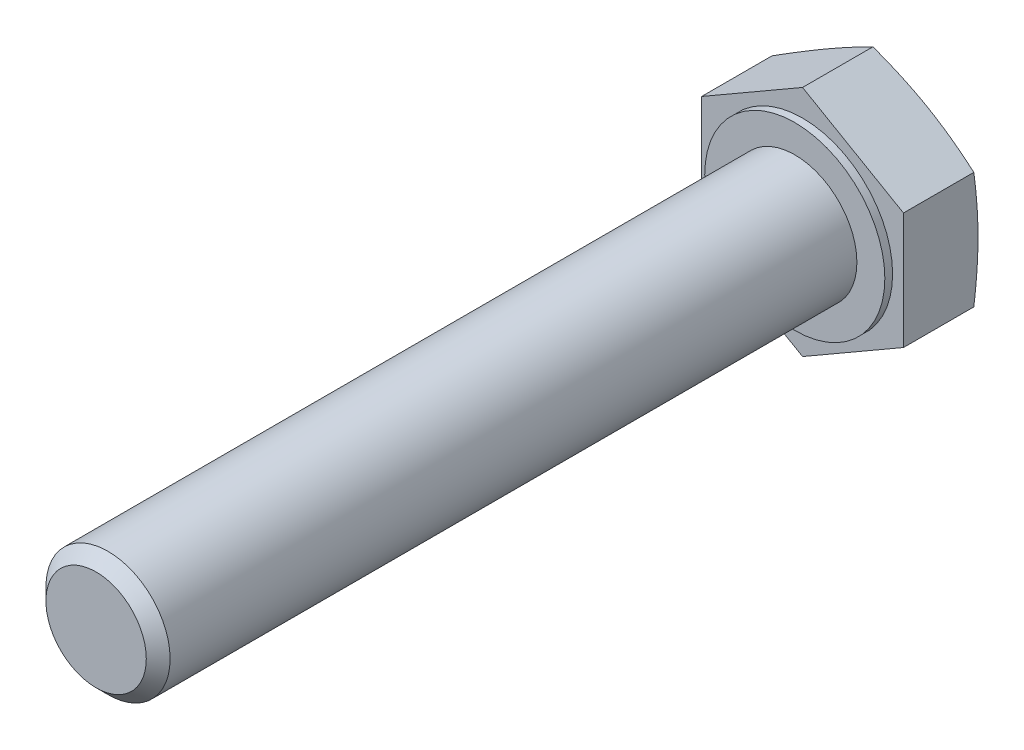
ISO-10303-21;
HEADER;
FILE_DESCRIPTION(('STEP AP214'),'2;1');
FILE_NAME('part.step','',(''),(''),'','','');
FILE_SCHEMA(('AUTOMOTIVE_DESIGN { 1 0 10303 214 1 1 1 1 }'));
ENDSEC;
DATA;
#1=APPLICATION_CONTEXT('core data for automotive mechanical design processes');
#2=APPLICATION_PROTOCOL_DEFINITION('international standard','automotive_design',2000,#1);
#3=PRODUCT_CONTEXT('',#1,'mechanical');
#4=PRODUCT('Part','Part','',(#3));
#5=PRODUCT_RELATED_PRODUCT_CATEGORY('part','',(#4));
#6=PRODUCT_DEFINITION_FORMATION('','',#4);
#7=PRODUCT_DEFINITION_CONTEXT('part definition',#1,'design');
#8=PRODUCT_DEFINITION('design','',#6,#7);
#9=PRODUCT_DEFINITION_SHAPE('','',#8);
#10=(LENGTH_UNIT() NAMED_UNIT(*) SI_UNIT(.MILLI.,.METRE.));
#11=(NAMED_UNIT(*) PLANE_ANGLE_UNIT() SI_UNIT($,.RADIAN.));
#12=(NAMED_UNIT(*) SI_UNIT($,.STERADIAN.) SOLID_ANGLE_UNIT());
#13=UNCERTAINTY_MEASURE_WITH_UNIT(LENGTH_MEASURE(1.E-05),#10,'distance_accuracy_value','');
#14=(GEOMETRIC_REPRESENTATION_CONTEXT(3) GLOBAL_UNCERTAINTY_ASSIGNED_CONTEXT((#13)) GLOBAL_UNIT_ASSIGNED_CONTEXT((#10,
#11,#12)) REPRESENTATION_CONTEXT('',''));
#15=CARTESIAN_POINT('',(0.,0.,0.));
#16=DIRECTION('',(0.,0.,1.));
#17=DIRECTION('',(1.,0.,0.));
#18=AXIS2_PLACEMENT_3D('',#15,#16,#17);
#19=CARTESIAN_POINT('',(0.,-10.5,4.8));
#20=DIRECTION('',(0.,0.,1.));
#21=DIRECTION('',(-1.,0.,0.));
#22=AXIS2_PLACEMENT_3D('',#19,#20,#21);
#23=PLANE('',#22);
#24=CARTESIAN_POINT('',(0.,0.,4.8));
#25=DIRECTION('',(0.,0.,-1.));
#26=DIRECTION('',(1.,0.,0.));
#27=AXIS2_PLACEMENT_3D('',#24,#25,#26);
#28=CIRCLE('',#27,5.8);
#29=CARTESIAN_POINT('',(5.8,0.,4.8));
#30=VERTEX_POINT('',#29);
#31=EDGE_CURVE('E159',#30,#30,#28,.T.);
#32=ORIENTED_EDGE('',*,*,#31,.T.);
#33=EDGE_LOOP('',(#32));
#34=FACE_BOUND('',#33,.T.);
#35=DIRECTION('',(0.,1.,0.));
#36=VECTOR('',#35,1.);
#37=CARTESIAN_POINT('',(6.5,-10.5,4.8));
#38=LINE('',#37,#36);
#39=CARTESIAN_POINT('',(6.5,-3.7527767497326,4.8));
#40=VERTEX_POINT('',#39);
#41=CARTESIAN_POINT('',(6.5,3.7527767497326,4.8));
#42=VERTEX_POINT('',#41);
#43=EDGE_CURVE('E161',#40,#42,#38,.T.);
#44=ORIENTED_EDGE('',*,*,#43,.T.);
#45=DIRECTION('',(-0.866025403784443,0.499999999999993,0.));
#46=VECTOR('',#45,1.);
#47=CARTESIAN_POINT('',(7.79663336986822,3.00416512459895,4.8));
#48=LINE('',#47,#46);
#49=CARTESIAN_POINT('',(0.,7.5055534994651,4.8));
#50=VERTEX_POINT('',#49);
#51=EDGE_CURVE('E9',#42,#50,#48,.T.);
#52=ORIENTED_EDGE('',*,*,#51,.T.);
#53=DIRECTION('',(-0.866025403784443,-0.499999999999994,0.));
#54=VECTOR('',#53,1.);
#55=CARTESIAN_POINT('',(-7.79663336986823,3.00416512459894,4.8));
#56=LINE('',#55,#54);
#57=CARTESIAN_POINT('',(-6.5,3.7527767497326,4.8));
#58=VERTEX_POINT('',#57);
#59=EDGE_CURVE('E22',#50,#58,#56,.T.);
#60=ORIENTED_EDGE('',*,*,#59,.T.);
#61=DIRECTION('',(0.,-1.,0.));
#62=VECTOR('',#61,1.);
#63=CARTESIAN_POINT('',(-6.5,-10.5,4.8));
#64=LINE('',#63,#62);
#65=CARTESIAN_POINT('',(-6.5,-3.7527767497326,4.8));
#66=VERTEX_POINT('',#65);
#67=EDGE_CURVE('E175',#58,#66,#64,.T.);
#68=ORIENTED_EDGE('',*,*,#67,.T.);
#69=DIRECTION('',(0.866025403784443,-0.499999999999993,0.));
#70=VECTOR('',#69,1.);
#71=CARTESIAN_POINT('',(1.29663336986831,-8.25416512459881,4.8));
#72=LINE('',#71,#70);
#73=CARTESIAN_POINT('',(0.,-7.5055534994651,4.8));
#74=VERTEX_POINT('',#73);
#75=EDGE_CURVE('E167',#66,#74,#72,.T.);
#76=ORIENTED_EDGE('',*,*,#75,.T.);
#77=DIRECTION('',(0.866025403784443,0.499999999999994,0.));
#78=VECTOR('',#77,1.);
#79=CARTESIAN_POINT('',(-1.29663336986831,-8.25416512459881,4.8));
#80=LINE('',#79,#78);
#81=EDGE_CURVE('E164',#74,#40,#80,.T.);
#82=ORIENTED_EDGE('',*,*,#81,.T.);
#83=EDGE_LOOP('',(#44,#52,#60,#68,#76,#82));
#84=FACE_BOUND('',#83,.T.);
#85=ADVANCED_FACE('F14',(#34,#84),#23,.T.);
#86=CARTESIAN_POINT('',(0.,0.,50.3));
#87=DIRECTION('',(0.,0.,-1.));
#88=DIRECTION('',(1.,0.,0.));
#89=AXIS2_PLACEMENT_3D('',#86,#87,#88);
#90=CYLINDRICAL_SURFACE('',#89,5.8);
#91=CARTESIAN_POINT('',(0.,0.,5.3));
#92=DIRECTION('',(0.,0.,-1.));
#93=DIRECTION('',(1.,0.,0.));
#94=AXIS2_PLACEMENT_3D('',#91,#92,#93);
#95=CIRCLE('',#94,5.8);
#96=CARTESIAN_POINT('',(5.8,0.,5.3));
#97=VERTEX_POINT('',#96);
#98=EDGE_CURVE('E251',#97,#97,#95,.T.);
#99=ORIENTED_EDGE('',*,*,#98,.T.);
#100=EDGE_LOOP('',(#99));
#101=FACE_BOUND('',#100,.T.);
#102=ORIENTED_EDGE('',*,*,#31,.F.);
#103=EDGE_LOOP('',(#102));
#104=FACE_BOUND('',#103,.T.);
#105=ADVANCED_FACE('F147',(#101,#104),#90,.T.);
#106=CARTESIAN_POINT('',(0.,-5.8,5.3));
#107=DIRECTION('',(0.,0.,1.));
#108=DIRECTION('',(-1.,0.,0.));
#109=AXIS2_PLACEMENT_3D('',#106,#107,#108);
#110=PLANE('',#109);
#111=CARTESIAN_POINT('',(0.,0.,5.3));
#112=DIRECTION('',(0.,0.,-1.));
#113=DIRECTION('',(1.,0.,0.));
#114=AXIS2_PLACEMENT_3D('',#111,#112,#113);
#115=CIRCLE('',#114,4.);
#116=CARTESIAN_POINT('',(4.,0.,5.3));
#117=VERTEX_POINT('',#116);
#118=EDGE_CURVE('E253',#117,#117,#115,.T.);
#119=ORIENTED_EDGE('',*,*,#118,.T.);
#120=EDGE_LOOP('',(#119));
#121=FACE_BOUND('',#120,.T.);
#122=ORIENTED_EDGE('',*,*,#98,.F.);
#123=EDGE_LOOP('',(#122));
#124=FACE_BOUND('',#123,.T.);
#125=ADVANCED_FACE('F143',(#121,#124),#110,.T.);
#126=CARTESIAN_POINT('',(0.,0.,50.3));
#127=DIRECTION('',(0.,0.,-1.));
#128=DIRECTION('',(1.,0.,0.));
#129=AXIS2_PLACEMENT_3D('',#126,#127,#128);
#130=CYLINDRICAL_SURFACE('',#129,4.);
#131=CARTESIAN_POINT('',(0.,0.,49.533));
#132=DIRECTION('',(0.,0.,-1.));
#133=DIRECTION('',(1.,0.,0.));
#134=AXIS2_PLACEMENT_3D('',#131,#132,#133);
#135=CIRCLE('',#134,4.);
#136=CARTESIAN_POINT('',(4.,0.,49.533));
#137=VERTEX_POINT('',#136);
#138=EDGE_CURVE('E257',#137,#137,#135,.T.);
#139=ORIENTED_EDGE('',*,*,#138,.T.);
#140=EDGE_LOOP('',(#139));
#141=FACE_BOUND('',#140,.T.);
#142=ORIENTED_EDGE('',*,*,#118,.F.);
#143=EDGE_LOOP('',(#142));
#144=FACE_BOUND('',#143,.T.);
#145=ADVANCED_FACE('F139',(#141,#144),#130,.T.);
#146=CARTESIAN_POINT('',(0.,0.,49.533));
#147=DIRECTION('',(0.,0.,-1.));
#148=DIRECTION('',(1.,0.,0.));
#149=AXIS2_PLACEMENT_3D('',#146,#147,#148);
#150=CONICAL_SURFACE('',#149,4.,0.785398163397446);
#151=CARTESIAN_POINT('',(0.,0.,50.3));
#152=DIRECTION('',(0.,0.,-1.));
#153=DIRECTION('',(1.,0.,0.));
#154=AXIS2_PLACEMENT_3D('',#151,#152,#153);
#155=CIRCLE('',#154,3.233);
#156=CARTESIAN_POINT('',(3.233,0.,50.3));
#157=VERTEX_POINT('',#156);
#158=EDGE_CURVE('E105',#157,#157,#155,.T.);
#159=ORIENTED_EDGE('',*,*,#158,.T.);
#160=EDGE_LOOP('',(#159));
#161=FACE_BOUND('',#160,.T.);
#162=ORIENTED_EDGE('',*,*,#138,.F.);
#163=EDGE_LOOP('',(#162));
#164=FACE_BOUND('',#163,.T.);
#165=ADVANCED_FACE('F135',(#161,#164),#150,.T.);
#166=CARTESIAN_POINT('',(0.,-3.233,50.3));
#167=DIRECTION('',(0.,0.,1.));
#168=DIRECTION('',(-1.,0.,0.));
#169=AXIS2_PLACEMENT_3D('',#166,#167,#168);
#170=PLANE('',#169);
#171=ORIENTED_EDGE('',*,*,#158,.F.);
#172=EDGE_LOOP('',(#171));
#173=FACE_BOUND('',#172,.T.);
#174=ADVANCED_FACE('F130',(#173),#170,.T.);
#175=CARTESIAN_POINT('',(6.5,3.7527767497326,0.));
#176=DIRECTION('',(0.499999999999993,0.866025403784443,0.));
#177=DIRECTION('',(-0.866025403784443,0.499999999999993,0.));
#178=AXIS2_PLACEMENT_3D('',#175,#176,#177);
#179=PLANE('',#178);
#180=DIRECTION('',(0.,0.,1.));
#181=VECTOR('',#180,1.);
#182=CARTESIAN_POINT('',(0.,7.5055534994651,0.));
#183=LINE('',#182,#181);
#184=CARTESIAN_POINT('',(0.,7.5055534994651,0.269437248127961));
#185=VERTEX_POINT('',#184);
#186=EDGE_CURVE('E180',#185,#50,#183,.T.);
#187=ORIENTED_EDGE('',*,*,#186,.T.);
#188=ORIENTED_EDGE('',*,*,#51,.F.);
#189=DIRECTION('',(0.,0.,1.));
#190=VECTOR('',#189,1.);
#191=CARTESIAN_POINT('',(6.5,3.7527767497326,0.));
#192=LINE('',#191,#190);
#193=CARTESIAN_POINT('',(6.5,3.7527767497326,0.26943724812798));
#194=VERTEX_POINT('',#193);
#195=EDGE_CURVE('E35',#194,#42,#192,.T.);
#196=ORIENTED_EDGE('',*,*,#195,.F.);
#197=CARTESIAN_POINT('',(-0.000200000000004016,7.50566896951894,0.269468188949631));
#198=CARTESIAN_POINT('',(0.269745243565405,7.34981601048,0.227689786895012));
#199=CARTESIAN_POINT('',(0.540179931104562,7.19368047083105,0.189761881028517));
#200=CARTESIAN_POINT('',(1.08200437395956,6.88085798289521,0.123126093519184));
#201=CARTESIAN_POINT('',(1.35339447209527,6.72417083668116,0.0944219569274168));
#202=CARTESIAN_POINT('',(1.89548428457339,6.41119513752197,0.0479094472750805));
#203=CARTESIAN_POINT('',(2.16618033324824,6.25490870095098,0.030045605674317));
#204=CARTESIAN_POINT('',(2.70791763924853,5.94213652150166,0.0060920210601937));
#205=CARTESIAN_POINT('',(2.97895881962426,5.78565082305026,0.));
#206=CARTESIAN_POINT('',(3.52104118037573,5.47267942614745,0.));
#207=CARTESIAN_POINT('',(3.79208236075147,5.31619372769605,0.00609202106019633));
#208=CARTESIAN_POINT('',(4.33381966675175,5.00342154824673,0.0300456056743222));
#209=CARTESIAN_POINT('',(4.60451571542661,4.84713511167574,0.0479094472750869));
#210=CARTESIAN_POINT('',(5.14660552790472,4.53415941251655,0.0944219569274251));
#211=CARTESIAN_POINT('',(5.41799562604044,4.3774722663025,0.123126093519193));
#212=CARTESIAN_POINT('',(5.95982006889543,4.06464977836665,0.18976188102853));
#213=CARTESIAN_POINT('',(6.23025475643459,3.90851423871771,0.227689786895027));
#214=CARTESIAN_POINT('',(6.5002,3.75266127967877,0.269468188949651));
#215=B_SPLINE_CURVE_WITH_KNOTS('',3,(#197,#198,#199,#200,#201,#202,#203,#204,#205,#206,#207,
#208,#209,#210,#211,#212,#213,#214),.UNSPECIFIED.,.F.,.F.,(4,2,2,2,2,2,2,2,4),(0.,
0.943529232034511,1.88744107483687,2.82648138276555,3.76533995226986,4.70419852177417,
5.64323882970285,6.58715067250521,7.53067990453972),.UNSPECIFIED.);
#216=CARTESIAN_POINT('',(3.24999999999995,5.62916512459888,0.));
#217=VERTEX_POINT('',#216);
#218=EDGE_CURVE('E95',#217,#194,#215,.T.);
#219=ORIENTED_EDGE('',*,*,#218,.F.);
#220=EDGE_CURVE('E102',#185,#217,#215,.T.);
#221=ORIENTED_EDGE('',*,*,#220,.F.);
#222=EDGE_LOOP('',(#187,#188,#196,#219,#221));
#223=FACE_BOUND('',#222,.T.);
#224=ADVANCED_FACE('F94',(#223),#179,.T.);
#225=CARTESIAN_POINT('',(0.,7.5055534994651,0.));
#226=DIRECTION('',(-0.499999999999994,0.866025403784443,0.));
#227=DIRECTION('',(-0.866025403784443,-0.499999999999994,0.));
#228=AXIS2_PLACEMENT_3D('',#225,#226,#227);
#229=PLANE('',#228);
#230=DIRECTION('',(0.,0.,1.));
#231=VECTOR('',#230,1.);
#232=CARTESIAN_POINT('',(-6.5,3.7527767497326,0.));
#233=LINE('',#232,#231);
#234=CARTESIAN_POINT('',(-6.5,3.7527767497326,0.26943724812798));
#235=VERTEX_POINT('',#234);
#236=EDGE_CURVE('E183',#235,#58,#233,.T.);
#237=ORIENTED_EDGE('',*,*,#236,.T.);
#238=ORIENTED_EDGE('',*,*,#59,.F.);
#239=ORIENTED_EDGE('',*,*,#186,.F.);
#240=CARTESIAN_POINT('',(-6.5002,3.75266127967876,0.269468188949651));
#241=CARTESIAN_POINT('',(-6.23025475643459,3.9085142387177,0.227689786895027));
#242=CARTESIAN_POINT('',(-5.95982006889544,4.06464977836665,0.189761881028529));
#243=CARTESIAN_POINT('',(-5.41799562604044,4.37747226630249,0.123126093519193));
#244=CARTESIAN_POINT('',(-5.14660552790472,4.53415941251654,0.0944219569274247));
#245=CARTESIAN_POINT('',(-4.60451571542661,4.84713511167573,0.0479094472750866));
#246=CARTESIAN_POINT('',(-4.33381966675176,5.00342154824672,0.0300456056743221));
#247=CARTESIAN_POINT('',(-3.79208236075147,5.31619372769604,0.00609202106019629));
#248=CARTESIAN_POINT('',(-3.52104118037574,5.47267942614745,0.));
#249=CARTESIAN_POINT('',(-2.97895881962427,5.78565082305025,0.));
#250=CARTESIAN_POINT('',(-2.70791763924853,5.94213652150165,0.00609202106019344));
#251=CARTESIAN_POINT('',(-2.16618033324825,6.25490870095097,0.0300456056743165));
#252=CARTESIAN_POINT('',(-1.8954842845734,6.41119513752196,0.0479094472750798));
#253=CARTESIAN_POINT('',(-1.35339447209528,6.72417083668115,0.0944219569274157));
#254=CARTESIAN_POINT('',(-1.08200437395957,6.8808579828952,0.123126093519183));
#255=CARTESIAN_POINT('',(-0.54017993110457,7.19368047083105,0.189761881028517));
#256=CARTESIAN_POINT('',(-0.269745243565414,7.34981601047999,0.227689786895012));
#257=CARTESIAN_POINT('',(0.000199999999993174,7.50566896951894,0.269468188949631));
#258=B_SPLINE_CURVE_WITH_KNOTS('',3,(#240,#241,#242,#243,#244,#245,#246,#247,#248,#249,#250,
#251,#252,#253,#254,#255,#256,#257),.UNSPECIFIED.,.F.,.F.,(4,2,2,2,2,2,2,2,4),(0.,
0.94352923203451,1.88744107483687,2.82648138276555,3.76533995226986,4.70419852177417,
5.64323882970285,6.5871506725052,7.53067990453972),.UNSPECIFIED.);
#259=CARTESIAN_POINT('',(-3.24999999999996,5.62916512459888,0.));
#260=VERTEX_POINT('',#259);
#261=EDGE_CURVE('E107',#260,#185,#258,.T.);
#262=ORIENTED_EDGE('',*,*,#261,.F.);
#263=EDGE_CURVE('E103',#235,#260,#258,.T.);
#264=ORIENTED_EDGE('',*,*,#263,.F.);
#265=EDGE_LOOP('',(#237,#238,#239,#262,#264));
#266=FACE_BOUND('',#265,.T.);
#267=ADVANCED_FACE('F129',(#266),#229,.T.);
#268=CARTESIAN_POINT('',(-6.5,3.7527767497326,0.));
#269=DIRECTION('',(-1.,0.,0.));
#270=DIRECTION('',(0.,-1.,0.));
#271=AXIS2_PLACEMENT_3D('',#268,#269,#270);
#272=PLANE('',#271);
#273=DIRECTION('',(0.,0.,1.));
#274=VECTOR('',#273,1.);
#275=CARTESIAN_POINT('',(-6.5,-3.7527767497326,0.));
#276=LINE('',#275,#274);
#277=CARTESIAN_POINT('',(-6.5,-3.7527767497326,0.26943724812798));
#278=VERTEX_POINT('',#277);
#279=EDGE_CURVE('E185',#278,#66,#276,.T.);
#280=ORIENTED_EDGE('',*,*,#279,.T.);
#281=ORIENTED_EDGE('',*,*,#67,.F.);
#282=ORIENTED_EDGE('',*,*,#236,.F.);
#283=CARTESIAN_POINT('',(-6.5,9.97969617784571,1.44956278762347));
#284=CARTESIAN_POINT('',(-6.5,9.68420436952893,1.38323529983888));
#285=CARTESIAN_POINT('',(-6.5,9.38852917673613,1.31771031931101));
#286=CARTESIAN_POINT('',(-6.5,8.79672184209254,1.18869864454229));
#287=CARTESIAN_POINT('',(-6.5,8.500589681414,1.12521203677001));
#288=CARTESIAN_POINT('',(-6.5,7.9075205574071,1.00065670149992));
#289=CARTESIAN_POINT('',(-6.5,7.61058309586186,0.939590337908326));
#290=CARTESIAN_POINT('',(-6.5,7.01609389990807,0.820526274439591));
#291=CARTESIAN_POINT('',(-6.5,6.71854217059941,0.762528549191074));
#292=CARTESIAN_POINT('',(-6.5,6.12509411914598,0.650781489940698));
#293=CARTESIAN_POINT('',(-6.5,5.82920350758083,0.597001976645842));
#294=CARTESIAN_POINT('',(-6.5,5.2366181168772,0.494081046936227));
#295=CARTESIAN_POINT('',(-6.5,4.93992335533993,0.444939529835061));
#296=CARTESIAN_POINT('',(-6.5,4.3456656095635,0.352389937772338));
#297=CARTESIAN_POINT('',(-6.5,4.04810272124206,0.30898125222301));
#298=CARTESIAN_POINT('',(-6.5,3.45202840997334,0.229166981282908));
#299=CARTESIAN_POINT('',(-6.5,3.1535169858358,0.19276140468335));
#300=CARTESIAN_POINT('',(-6.5,2.55215457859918,0.127972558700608));
#301=CARTESIAN_POINT('',(-6.5,2.24929303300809,0.0996858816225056));
#302=CARTESIAN_POINT('',(-6.5,1.64279733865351,0.0530793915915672));
#303=CARTESIAN_POINT('',(-6.5,1.33916320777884,0.0347593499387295));
#304=CARTESIAN_POINT('',(-6.5,0.731564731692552,0.00915396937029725));
#305=CARTESIAN_POINT('',(-6.5,0.427600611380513,0.00186340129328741));
#306=CARTESIAN_POINT('',(-6.5,-0.180386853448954,-0.001233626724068));
#307=CARTESIAN_POINT('',(-6.5,-0.484410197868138,0.00295989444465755));
#308=CARTESIAN_POINT('',(-6.5,-1.09320909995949,0.0225961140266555));
#309=CARTESIAN_POINT('',(-6.5,-1.39798329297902,0.0380802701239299));
#310=CARTESIAN_POINT('',(-6.5,-2.00682189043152,0.0794096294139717));
#311=CARTESIAN_POINT('',(-6.5,-2.31088627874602,0.105255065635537));
#312=CARTESIAN_POINT('',(-6.5,-2.91830202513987,0.165988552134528));
#313=CARTESIAN_POINT('',(-6.5,-3.22165276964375,0.200882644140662));
#314=CARTESIAN_POINT('',(-6.5,-3.82737583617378,0.278245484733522));
#315=CARTESIAN_POINT('',(-6.5,-4.12974815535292,0.320714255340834));
#316=CARTESIAN_POINT('',(-6.5,-4.71998026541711,0.409804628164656));
#317=CARTESIAN_POINT('',(-6.5,-5.00788158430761,0.45615383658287));
#318=CARTESIAN_POINT('',(-6.5,-5.58290655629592,0.553470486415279));
#319=CARTESIAN_POINT('',(-6.5,-5.87003018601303,0.60443806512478));
#320=CARTESIAN_POINT('',(-6.5,-6.44361120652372,0.7101276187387));
#321=CARTESIAN_POINT('',(-6.5,-6.73006852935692,0.764849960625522));
#322=CARTESIAN_POINT('',(-6.5,-7.30238443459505,0.877348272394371));
#323=CARTESIAN_POINT('',(-6.5,-7.58824300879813,0.935124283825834));
#324=CARTESIAN_POINT('',(-6.5,-8.44519684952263,1.11218778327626));
#325=CARTESIAN_POINT('',(-6.5,-9.01552504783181,1.23518334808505));
#326=CARTESIAN_POINT('',(-6.5,-10.154654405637,1.48781777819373));
#327=CARTESIAN_POINT('',(-6.5,-10.723455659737,1.61745622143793));
#328=CARTESIAN_POINT('',(-6.5,-11.8542497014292,1.88005352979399));
#329=CARTESIAN_POINT('',(-6.5,-12.4162533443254,2.01296577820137));
#330=CARTESIAN_POINT('',(-6.5,-13.5394835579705,2.28207230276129));
#331=CARTESIAN_POINT('',(-6.5,-14.1007101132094,2.41826664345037));
#332=CARTESIAN_POINT('',(-6.5,-15.2218390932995,2.6928903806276));
#333=CARTESIAN_POINT('',(-6.5,-15.781742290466,2.83131663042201));
#334=CARTESIAN_POINT('',(-6.5,-16.9010676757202,3.11002037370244));
#335=CARTESIAN_POINT('',(-6.5,-17.460489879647,3.25029780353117));
#336=CARTESIAN_POINT('',(-6.5,-18.0197457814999,3.39122723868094));
#337=B_SPLINE_CURVE_WITH_KNOTS('',3,(#283,#284,#285,#286,#287,#288,#289,#290,#291,#292,#293,
#294,#295,#296,#297,#298,#299,#300,#301,#302,#303,#304,#305,#306,#307,#308,#309,#310,#311,#312,
#313,#314,#315,#316,#317,#318,#319,#320,#321,#322,#323,#324,#325,#326,#327,#328,#329,#330,#331,
#332,#333,#334,#335,#336),.UNSPECIFIED.,.F.,.F.,(4,2,2,2,2,2,2,2,2,2,2,2,2,2,2,2,2,2,2,2,2,2,2,
2,2,2,4),(0.,0.908536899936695,1.81711228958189,2.72655426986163,3.63598872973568,
4.53817398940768,5.44033965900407,6.34240916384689,7.24447980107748,8.15687548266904,
9.06925022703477,9.98119227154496,10.893132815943,11.8084388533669,12.7237654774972,
13.6397048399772,14.5556468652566,15.4304269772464,16.305233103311,17.1801248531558,
18.05502851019,19.8052789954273,21.5554184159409,23.2879238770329,25.0204634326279,
26.7507433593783,28.4809639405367),.UNSPECIFIED.);
#338=CARTESIAN_POINT('',(-6.5,0.,0.));
#339=VERTEX_POINT('',#338);
#340=EDGE_CURVE('E221',#339,#235,#337,.F.);
#341=ORIENTED_EDGE('',*,*,#340,.F.);
#342=EDGE_CURVE('E227',#278,#339,#337,.F.);
#343=ORIENTED_EDGE('',*,*,#342,.F.);
#344=EDGE_LOOP('',(#280,#281,#282,#341,#343));
#345=FACE_BOUND('',#344,.T.);
#346=ADVANCED_FACE('F215',(#345),#272,.T.);
#347=CARTESIAN_POINT('',(-6.5,-3.7527767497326,0.));
#348=DIRECTION('',(-0.499999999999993,-0.866025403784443,0.));
#349=DIRECTION('',(0.866025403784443,-0.499999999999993,0.));
#350=AXIS2_PLACEMENT_3D('',#347,#348,#349);
#351=PLANE('',#350);
#352=DIRECTION('',(0.,0.,1.));
#353=VECTOR('',#352,1.);
#354=CARTESIAN_POINT('',(0.,-7.5055534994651,0.));
#355=LINE('',#354,#353);
#356=CARTESIAN_POINT('',(0.,-7.5055534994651,0.269437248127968));
#357=VERTEX_POINT('',#356);
#358=EDGE_CURVE('E596',#357,#74,#355,.T.);
#359=ORIENTED_EDGE('',*,*,#358,.T.);
#360=ORIENTED_EDGE('',*,*,#75,.F.);
#361=ORIENTED_EDGE('',*,*,#279,.F.);
#362=CARTESIAN_POINT('',(0.000200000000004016,-7.50566896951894,0.269468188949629));
#363=CARTESIAN_POINT('',(-0.269745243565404,-7.34981601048,0.227689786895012));
#364=CARTESIAN_POINT('',(-0.540179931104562,-7.19368047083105,0.189761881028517));
#365=CARTESIAN_POINT('',(-1.08200437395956,-6.88085798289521,0.123126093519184));
#366=CARTESIAN_POINT('',(-1.35339447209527,-6.72417083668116,0.0944219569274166));
#367=CARTESIAN_POINT('',(-1.89548428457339,-6.41119513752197,0.0479094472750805));
#368=CARTESIAN_POINT('',(-2.16618033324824,-6.25490870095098,0.0300456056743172));
#369=CARTESIAN_POINT('',(-2.70791763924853,-5.94213652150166,0.00609202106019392));
#370=CARTESIAN_POINT('',(-2.97895881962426,-5.78565082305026,0.));
#371=CARTESIAN_POINT('',(-3.52104118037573,-5.47267942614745,0.));
#372=CARTESIAN_POINT('',(-3.79208236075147,-5.31619372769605,0.00609202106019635));
#373=CARTESIAN_POINT('',(-4.33381966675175,-5.00342154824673,0.0300456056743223));
#374=CARTESIAN_POINT('',(-4.60451571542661,-4.84713511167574,0.0479094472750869));
#375=CARTESIAN_POINT('',(-5.14660552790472,-4.53415941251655,0.0944219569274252));
#376=CARTESIAN_POINT('',(-5.41799562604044,-4.3774722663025,0.123126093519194));
#377=CARTESIAN_POINT('',(-5.95982006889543,-4.06464977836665,0.18976188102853));
#378=CARTESIAN_POINT('',(-6.23025475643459,-3.90851423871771,0.227689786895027));
#379=CARTESIAN_POINT('',(-6.5002,-3.75266127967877,0.269468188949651));
#380=B_SPLINE_CURVE_WITH_KNOTS('',3,(#362,#363,#364,#365,#366,#367,#368,#369,#370,#371,#372,
#373,#374,#375,#376,#377,#378,#379),.UNSPECIFIED.,.F.,.F.,(4,2,2,2,2,2,2,2,4),(0.,
0.943529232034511,1.88744107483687,2.82648138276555,3.76533995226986,4.70419852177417,
5.64323882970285,6.58715067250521,7.53067990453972),.UNSPECIFIED.);
#381=CARTESIAN_POINT('',(-3.24999999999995,-5.62916512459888,0.));
#382=VERTEX_POINT('',#381);
#383=EDGE_CURVE('E201',#382,#278,#380,.T.);
#384=ORIENTED_EDGE('',*,*,#383,.F.);
#385=EDGE_CURVE('E228',#357,#382,#380,.T.);
#386=ORIENTED_EDGE('',*,*,#385,.F.);
#387=EDGE_LOOP('',(#359,#360,#361,#384,#386));
#388=FACE_BOUND('',#387,.T.);
#389=ADVANCED_FACE('F210',(#388),#351,.T.);
#390=CARTESIAN_POINT('',(0.,-7.5055534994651,0.));
#391=DIRECTION('',(0.499999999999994,-0.866025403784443,0.));
#392=DIRECTION('',(0.866025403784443,0.499999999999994,0.));
#393=AXIS2_PLACEMENT_3D('',#390,#391,#392);
#394=PLANE('',#393);
#395=DIRECTION('',(0.,0.,1.));
#396=VECTOR('',#395,1.);
#397=CARTESIAN_POINT('',(6.5,-3.7527767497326,0.));
#398=LINE('',#397,#396);
#399=CARTESIAN_POINT('',(6.5,-3.7527767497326,0.26943724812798));
#400=VERTEX_POINT('',#399);
#401=EDGE_CURVE('E29',#400,#40,#398,.T.);
#402=ORIENTED_EDGE('',*,*,#401,.T.);
#403=ORIENTED_EDGE('',*,*,#81,.F.);
#404=ORIENTED_EDGE('',*,*,#358,.F.);
#405=CARTESIAN_POINT('',(6.5002,-3.75266127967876,0.269468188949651));
#406=CARTESIAN_POINT('',(6.23025475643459,-3.9085142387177,0.227689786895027));
#407=CARTESIAN_POINT('',(5.95982006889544,-4.06464977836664,0.189761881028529));
#408=CARTESIAN_POINT('',(5.41799562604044,-4.37747226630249,0.123126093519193));
#409=CARTESIAN_POINT('',(5.14660552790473,-4.53415941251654,0.0944219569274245));
#410=CARTESIAN_POINT('',(4.60451571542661,-4.84713511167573,0.0479094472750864));
#411=CARTESIAN_POINT('',(4.33381966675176,-5.00342154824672,0.0300456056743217));
#412=CARTESIAN_POINT('',(3.79208236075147,-5.31619372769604,0.00609202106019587));
#413=CARTESIAN_POINT('',(3.52104118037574,-5.47267942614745,0.));
#414=CARTESIAN_POINT('',(2.97895881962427,-5.78565082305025,0.));
#415=CARTESIAN_POINT('',(2.70791763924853,-5.94213652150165,0.00609202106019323));
#416=CARTESIAN_POINT('',(2.16618033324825,-6.25490870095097,0.0300456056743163));
#417=CARTESIAN_POINT('',(1.8954842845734,-6.41119513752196,0.0479094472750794));
#418=CARTESIAN_POINT('',(1.35339447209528,-6.72417083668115,0.0944219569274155));
#419=CARTESIAN_POINT('',(1.08200437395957,-6.8808579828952,0.123126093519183));
#420=CARTESIAN_POINT('',(0.54017993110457,-7.19368047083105,0.189761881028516));
#421=CARTESIAN_POINT('',(0.269745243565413,-7.34981601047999,0.227689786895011));
#422=CARTESIAN_POINT('',(-0.000199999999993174,-7.50566896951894,0.269468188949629));
#423=B_SPLINE_CURVE_WITH_KNOTS('',3,(#405,#406,#407,#408,#409,#410,#411,#412,#413,#414,#415,
#416,#417,#418,#419,#420,#421,#422),.UNSPECIFIED.,.F.,.F.,(4,2,2,2,2,2,2,2,4),(0.,
0.943529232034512,1.88744107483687,2.82648138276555,3.76533995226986,4.70419852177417,
5.64323882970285,6.58715067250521,7.53067990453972),.UNSPECIFIED.);
#424=CARTESIAN_POINT('',(3.24999999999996,-5.62916512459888,0.));
#425=VERTEX_POINT('',#424);
#426=EDGE_CURVE('E90',#425,#357,#423,.T.);
#427=ORIENTED_EDGE('',*,*,#426,.F.);
#428=EDGE_CURVE('E200',#400,#425,#423,.T.);
#429=ORIENTED_EDGE('',*,*,#428,.F.);
#430=EDGE_LOOP('',(#402,#403,#404,#427,#429));
#431=FACE_BOUND('',#430,.T.);
#432=ADVANCED_FACE('F207',(#431),#394,.T.);
#433=CARTESIAN_POINT('',(6.5,-3.7527767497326,0.));
#434=DIRECTION('',(1.,0.,0.));
#435=DIRECTION('',(0.,1.,0.));
#436=AXIS2_PLACEMENT_3D('',#433,#434,#435);
#437=PLANE('',#436);
#438=ORIENTED_EDGE('',*,*,#195,.T.);
#439=ORIENTED_EDGE('',*,*,#43,.F.);
#440=ORIENTED_EDGE('',*,*,#401,.F.);
#441=CARTESIAN_POINT('',(6.5,9.97969617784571,1.44956278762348));
#442=CARTESIAN_POINT('',(6.5,9.68420436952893,1.38323529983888));
#443=CARTESIAN_POINT('',(6.5,9.38852917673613,1.31771031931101));
#444=CARTESIAN_POINT('',(6.5,8.79672184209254,1.18869864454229));
#445=CARTESIAN_POINT('',(6.5,8.500589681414,1.12521203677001));
#446=CARTESIAN_POINT('',(6.5,7.9075205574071,1.00065670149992));
#447=CARTESIAN_POINT('',(6.5,7.61058309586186,0.939590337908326));
#448=CARTESIAN_POINT('',(6.5,7.01609389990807,0.820526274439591));
#449=CARTESIAN_POINT('',(6.5,6.71854217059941,0.762528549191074));
#450=CARTESIAN_POINT('',(6.5,6.12509411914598,0.650781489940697));
#451=CARTESIAN_POINT('',(6.5,5.82920350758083,0.597001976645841));
#452=CARTESIAN_POINT('',(6.5,5.2366181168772,0.494081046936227));
#453=CARTESIAN_POINT('',(6.5,4.93992335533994,0.444939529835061));
#454=CARTESIAN_POINT('',(6.5,4.3456656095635,0.352389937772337));
#455=CARTESIAN_POINT('',(6.5,4.04810272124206,0.308981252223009));
#456=CARTESIAN_POINT('',(6.5,3.45202840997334,0.229166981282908));
#457=CARTESIAN_POINT('',(6.5,3.1535169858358,0.19276140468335));
#458=CARTESIAN_POINT('',(6.5,2.55215457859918,0.127972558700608));
#459=CARTESIAN_POINT('',(6.5,2.24929303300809,0.0996858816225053));
#460=CARTESIAN_POINT('',(6.5,1.64279733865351,0.0530793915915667));
#461=CARTESIAN_POINT('',(6.5,1.33916320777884,0.034759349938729));
#462=CARTESIAN_POINT('',(6.5,0.731564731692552,0.00915396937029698));
#463=CARTESIAN_POINT('',(6.5,0.427600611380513,0.00186340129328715));
#464=CARTESIAN_POINT('',(6.5,-0.180386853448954,-0.00123362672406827));
#465=CARTESIAN_POINT('',(6.5,-0.484410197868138,0.0029598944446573));
#466=CARTESIAN_POINT('',(6.5,-1.09320909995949,0.0225961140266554));
#467=CARTESIAN_POINT('',(6.5,-1.39798329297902,0.03808027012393));
#468=CARTESIAN_POINT('',(6.5,-2.00682189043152,0.0794096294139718));
#469=CARTESIAN_POINT('',(6.5,-2.31088627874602,0.105255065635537));
#470=CARTESIAN_POINT('',(6.5,-2.91830202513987,0.165988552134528));
#471=CARTESIAN_POINT('',(6.5,-3.22165276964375,0.200882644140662));
#472=CARTESIAN_POINT('',(6.5,-3.82737583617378,0.278245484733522));
#473=CARTESIAN_POINT('',(6.5,-4.12974815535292,0.320714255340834));
#474=CARTESIAN_POINT('',(6.5,-4.71998026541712,0.409804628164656));
#475=CARTESIAN_POINT('',(6.5,-5.00788158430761,0.45615383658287));
#476=CARTESIAN_POINT('',(6.5,-5.58290655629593,0.553470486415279));
#477=CARTESIAN_POINT('',(6.5,-5.87003018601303,0.60443806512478));
#478=CARTESIAN_POINT('',(6.5,-6.44361120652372,0.710127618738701));
#479=CARTESIAN_POINT('',(6.5,-6.73006852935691,0.764849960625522));
#480=CARTESIAN_POINT('',(6.5,-7.30238443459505,0.877348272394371));
#481=CARTESIAN_POINT('',(6.5,-7.58824300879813,0.935124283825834));
#482=CARTESIAN_POINT('',(6.5,-8.44519684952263,1.11218778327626));
#483=CARTESIAN_POINT('',(6.5,-9.01552504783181,1.23518334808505));
#484=CARTESIAN_POINT('',(6.5,-10.154654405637,1.48781777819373));
#485=CARTESIAN_POINT('',(6.5,-10.723455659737,1.61745622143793));
#486=CARTESIAN_POINT('',(6.5,-11.8542497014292,1.88005352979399));
#487=CARTESIAN_POINT('',(6.5,-12.4162533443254,2.01296577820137));
#488=CARTESIAN_POINT('',(6.5,-13.5394835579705,2.28207230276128));
#489=CARTESIAN_POINT('',(6.5,-14.1007101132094,2.41826664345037));
#490=CARTESIAN_POINT('',(6.5,-15.2218390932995,2.6928903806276));
#491=CARTESIAN_POINT('',(6.5,-15.781742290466,2.83131663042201));
#492=CARTESIAN_POINT('',(6.5,-16.9010676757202,3.11002037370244));
#493=CARTESIAN_POINT('',(6.5,-17.460489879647,3.25029780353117));
#494=CARTESIAN_POINT('',(6.5,-18.0197457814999,3.39122723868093));
#495=B_SPLINE_CURVE_WITH_KNOTS('',3,(#441,#442,#443,#444,#445,#446,#447,#448,#449,#450,#451,
#452,#453,#454,#455,#456,#457,#458,#459,#460,#461,#462,#463,#464,#465,#466,#467,#468,#469,#470,
#471,#472,#473,#474,#475,#476,#477,#478,#479,#480,#481,#482,#483,#484,#485,#486,#487,#488,#489,
#490,#491,#492,#493,#494),.UNSPECIFIED.,.F.,.F.,(4,2,2,2,2,2,2,2,2,2,2,2,2,2,2,2,2,2,2,2,2,2,2,
2,2,2,4),(0.,0.908536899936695,1.81711228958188,2.72655426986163,3.63598872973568,
4.53817398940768,5.44033965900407,6.34240916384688,7.24447980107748,8.15687548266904,
9.06925022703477,9.98119227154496,10.893132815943,11.8084388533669,12.7237654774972,
13.6397048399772,14.5556468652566,15.4304269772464,16.305233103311,17.1801248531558,
18.05502851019,19.8052789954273,21.5554184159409,23.2879238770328,25.0204634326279,
26.7507433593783,28.4809639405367),.UNSPECIFIED.);
#496=CARTESIAN_POINT('',(6.5,0.,0.));
#497=VERTEX_POINT('',#496);
#498=EDGE_CURVE('E85',#497,#400,#495,.T.);
#499=ORIENTED_EDGE('',*,*,#498,.F.);
#500=EDGE_CURVE('E82',#194,#497,#495,.T.);
#501=ORIENTED_EDGE('',*,*,#500,.F.);
#502=EDGE_LOOP('',(#438,#439,#440,#499,#501));
#503=FACE_BOUND('',#502,.T.);
#504=ADVANCED_FACE('F83',(#503),#437,.T.);
#505=CARTESIAN_POINT('',(0.,0.,0.));
#506=DIRECTION('',(0.,0.,1.));
#507=DIRECTION('',(-1.,0.,0.));
#508=AXIS2_PLACEMENT_3D('',#505,#506,#507);
#509=CONICAL_SURFACE('',#508,6.5,1.30899693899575);
#510=CARTESIAN_POINT('',(0.,0.,0.));
#511=DIRECTION('',(0.,0.,-1.));
#512=DIRECTION('',(1.,0.,0.));
#513=AXIS2_PLACEMENT_3D('',#510,#511,#512);
#514=CIRCLE('',#513,6.5);
#515=EDGE_CURVE('E100',#217,#497,#514,.T.);
#516=ORIENTED_EDGE('',*,*,#515,.F.);
#517=ORIENTED_EDGE('',*,*,#218,.T.);
#518=ORIENTED_EDGE('',*,*,#500,.T.);
#519=EDGE_LOOP('',(#516,#517,#518));
#520=FACE_BOUND('',#519,.T.);
#521=ADVANCED_FACE('F99',(#520),#509,.T.);
#522=EDGE_CURVE('E249',#260,#217,#514,.T.);
#523=ORIENTED_EDGE('',*,*,#522,.F.);
#524=ORIENTED_EDGE('',*,*,#261,.T.);
#525=ORIENTED_EDGE('',*,*,#220,.T.);
#526=EDGE_LOOP('',(#523,#524,#525));
#527=FACE_BOUND('',#526,.T.);
#528=ADVANCED_FACE('F272',(#527),#509,.T.);
#529=EDGE_CURVE('E250',#339,#260,#514,.T.);
#530=ORIENTED_EDGE('',*,*,#529,.F.);
#531=ORIENTED_EDGE('',*,*,#340,.T.);
#532=ORIENTED_EDGE('',*,*,#263,.T.);
#533=EDGE_LOOP('',(#530,#531,#532));
#534=FACE_BOUND('',#533,.T.);
#535=ADVANCED_FACE('F270',(#534),#509,.T.);
#536=ORIENTED_EDGE('',*,*,#383,.T.);
#537=ORIENTED_EDGE('',*,*,#342,.T.);
#538=EDGE_CURVE('E246',#382,#339,#514,.T.);
#539=ORIENTED_EDGE('',*,*,#538,.F.);
#540=EDGE_LOOP('',(#536,#537,#539));
#541=FACE_BOUND('',#540,.T.);
#542=ADVANCED_FACE('F122',(#541),#509,.T.);
#543=ORIENTED_EDGE('',*,*,#426,.T.);
#544=ORIENTED_EDGE('',*,*,#385,.T.);
#545=EDGE_CURVE('E170',#425,#382,#514,.T.);
#546=ORIENTED_EDGE('',*,*,#545,.F.);
#547=EDGE_LOOP('',(#543,#544,#546));
#548=FACE_BOUND('',#547,.T.);
#549=ADVANCED_FACE('F243',(#548),#509,.T.);
#550=CARTESIAN_POINT('',(0.,0.,0.));
#551=DIRECTION('',(0.,0.,-1.));
#552=DIRECTION('',(1.,0.,0.));
#553=AXIS2_PLACEMENT_3D('',#550,#551,#552);
#554=PLANE('',#553);
#555=EDGE_CURVE('E165',#497,#425,#514,.T.);
#556=ORIENTED_EDGE('',*,*,#555,.T.);
#557=ORIENTED_EDGE('',*,*,#545,.T.);
#558=ORIENTED_EDGE('',*,*,#538,.T.);
#559=ORIENTED_EDGE('',*,*,#529,.T.);
#560=ORIENTED_EDGE('',*,*,#522,.T.);
#561=ORIENTED_EDGE('',*,*,#515,.T.);
#562=EDGE_LOOP('',(#556,#557,#558,#559,#560,#561));
#563=FACE_BOUND('',#562,.T.);
#564=ADVANCED_FACE('F16',(#563),#554,.T.);
#565=ORIENTED_EDGE('',*,*,#498,.T.);
#566=ORIENTED_EDGE('',*,*,#428,.T.);
#567=ORIENTED_EDGE('',*,*,#555,.F.);
#568=EDGE_LOOP('',(#565,#566,#567));
#569=FACE_BOUND('',#568,.T.);
#570=ADVANCED_FACE('F241',(#569),#509,.T.);
#571=CLOSED_SHELL('',(#85,#105,#125,#145,#165,#174,#224,#267,#346,#389,#432,#504,#521,#528,#535,
#542,#549,#564,#570));
#572=MANIFOLD_SOLID_BREP('B1',#571);
#573=ADVANCED_BREP_SHAPE_REPRESENTATION('',(#18,#572),#14);
#574=SHAPE_DEFINITION_REPRESENTATION(#9,#573);
ENDSEC;
END-ISO-10303-21;
